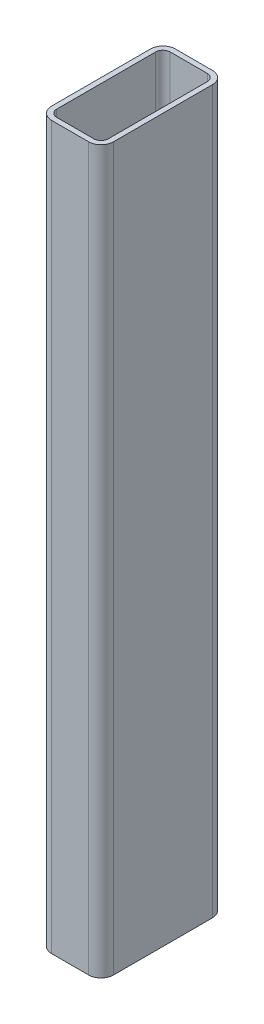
ISO-10303-21;
HEADER;
FILE_DESCRIPTION(('STEP AP214'),'2;1');
FILE_NAME('part.step','',(''),(''),'','','');
FILE_SCHEMA(('AUTOMOTIVE_DESIGN { 1 0 10303 214 1 1 1 1 }'));
ENDSEC;
DATA;
#1=APPLICATION_CONTEXT('core data for automotive mechanical design processes');
#2=APPLICATION_PROTOCOL_DEFINITION('international standard','automotive_design',2000,#1);
#3=PRODUCT_CONTEXT('',#1,'mechanical');
#4=PRODUCT('Part','Part','',(#3));
#5=PRODUCT_RELATED_PRODUCT_CATEGORY('part','',(#4));
#6=PRODUCT_DEFINITION_FORMATION('','',#4);
#7=PRODUCT_DEFINITION_CONTEXT('part definition',#1,'design');
#8=PRODUCT_DEFINITION('design','',#6,#7);
#9=PRODUCT_DEFINITION_SHAPE('','',#8);
#10=(LENGTH_UNIT() NAMED_UNIT(*) SI_UNIT(.MILLI.,.METRE.));
#11=(NAMED_UNIT(*) PLANE_ANGLE_UNIT() SI_UNIT($,.RADIAN.));
#12=(NAMED_UNIT(*) SI_UNIT($,.STERADIAN.) SOLID_ANGLE_UNIT());
#13=UNCERTAINTY_MEASURE_WITH_UNIT(LENGTH_MEASURE(1.E-05),#10,'distance_accuracy_value','');
#14=(GEOMETRIC_REPRESENTATION_CONTEXT(3) GLOBAL_UNCERTAINTY_ASSIGNED_CONTEXT((#13)) GLOBAL_UNIT_ASSIGNED_CONTEXT((#10,
#11,#12)) REPRESENTATION_CONTEXT('',''));
#15=CARTESIAN_POINT('',(0.,0.,0.));
#16=DIRECTION('',(0.,0.,1.));
#17=DIRECTION('',(1.,0.,0.));
#18=AXIS2_PLACEMENT_3D('',#15,#16,#17);
#19=CARTESIAN_POINT('',(-18.,700.,48.));
#20=DIRECTION('',(0.,-1.,0.));
#21=DIRECTION('',(0.,0.,-1.));
#22=AXIS2_PLACEMENT_3D('',#19,#20,#21);
#23=CYLINDRICAL_SURFACE('',#22,12.);
#24=CARTESIAN_POINT('',(-18.,0.,48.));
#25=DIRECTION('',(0.,1.,0.));
#26=DIRECTION('',(0.,0.,1.));
#27=AXIS2_PLACEMENT_3D('',#24,#25,#26);
#28=CIRCLE('',#27,12.);
#29=CARTESIAN_POINT('',(-30.,0.,48.));
#30=VERTEX_POINT('',#29);
#31=CARTESIAN_POINT('',(-18.,0.,60.));
#32=VERTEX_POINT('',#31);
#33=EDGE_CURVE('E190',#30,#32,#28,.T.);
#34=ORIENTED_EDGE('',*,*,#33,.T.);
#35=DIRECTION('',(0.,-1.,0.));
#36=VECTOR('',#35,1.);
#37=CARTESIAN_POINT('',(-18.,700.,60.));
#38=LINE('',#37,#36);
#39=CARTESIAN_POINT('',(-18.,700.,60.));
#40=VERTEX_POINT('',#39);
#41=EDGE_CURVE('E11',#40,#32,#38,.T.);
#42=ORIENTED_EDGE('',*,*,#41,.F.);
#43=CARTESIAN_POINT('',(-18.,700.,48.));
#44=DIRECTION('',(0.,1.,0.));
#45=DIRECTION('',(0.,0.,1.));
#46=AXIS2_PLACEMENT_3D('',#43,#44,#45);
#47=CIRCLE('',#46,12.);
#48=CARTESIAN_POINT('',(-30.,700.,48.));
#49=VERTEX_POINT('',#48);
#50=EDGE_CURVE('E228',#49,#40,#47,.T.);
#51=ORIENTED_EDGE('',*,*,#50,.F.);
#52=DIRECTION('',(0.,-1.,0.));
#53=VECTOR('',#52,1.);
#54=CARTESIAN_POINT('',(-30.,700.,48.));
#55=LINE('',#54,#53);
#56=EDGE_CURVE('E160',#49,#30,#55,.T.);
#57=ORIENTED_EDGE('',*,*,#56,.T.);
#58=EDGE_LOOP('',(#34,#42,#51,#57));
#59=FACE_BOUND('',#58,.T.);
#60=ADVANCED_FACE('F35',(#59),#23,.T.);
#61=CARTESIAN_POINT('',(-18.,700.,60.));
#62=DIRECTION('',(0.,0.,-1.));
#63=DIRECTION('',(-1.,0.,0.));
#64=AXIS2_PLACEMENT_3D('',#61,#62,#63);
#65=PLANE('',#64);
#66=DIRECTION('',(1.,0.,0.));
#67=VECTOR('',#66,1.);
#68=CARTESIAN_POINT('',(-18.,0.,60.));
#69=LINE('',#68,#67);
#70=CARTESIAN_POINT('',(18.,0.,60.));
#71=VERTEX_POINT('',#70);
#72=EDGE_CURVE('E193',#32,#71,#69,.T.);
#73=ORIENTED_EDGE('',*,*,#72,.T.);
#74=DIRECTION('',(0.,-1.,0.));
#75=VECTOR('',#74,1.);
#76=CARTESIAN_POINT('',(18.,700.,60.));
#77=LINE('',#76,#75);
#78=CARTESIAN_POINT('',(18.,700.,60.));
#79=VERTEX_POINT('',#78);
#80=EDGE_CURVE('E44',#79,#71,#77,.T.);
#81=ORIENTED_EDGE('',*,*,#80,.F.);
#82=DIRECTION('',(1.,0.,0.));
#83=VECTOR('',#82,1.);
#84=CARTESIAN_POINT('',(-18.,700.,60.));
#85=LINE('',#84,#83);
#86=EDGE_CURVE('E230',#40,#79,#85,.T.);
#87=ORIENTED_EDGE('',*,*,#86,.F.);
#88=ORIENTED_EDGE('',*,*,#41,.T.);
#89=EDGE_LOOP('',(#73,#81,#87,#88));
#90=FACE_BOUND('',#89,.T.);
#91=ADVANCED_FACE('F304',(#90),#65,.F.);
#92=CARTESIAN_POINT('',(18.,700.,48.));
#93=DIRECTION('',(0.,-1.,0.));
#94=DIRECTION('',(0.,0.,-1.));
#95=AXIS2_PLACEMENT_3D('',#92,#93,#94);
#96=CYLINDRICAL_SURFACE('',#95,12.);
#97=CARTESIAN_POINT('',(18.,0.,48.));
#98=DIRECTION('',(0.,1.,0.));
#99=DIRECTION('',(0.,0.,1.));
#100=AXIS2_PLACEMENT_3D('',#97,#98,#99);
#101=CIRCLE('',#100,12.);
#102=CARTESIAN_POINT('',(30.,0.,48.));
#103=VERTEX_POINT('',#102);
#104=EDGE_CURVE('E195',#71,#103,#101,.T.);
#105=ORIENTED_EDGE('',*,*,#104,.T.);
#106=DIRECTION('',(0.,-1.,0.));
#107=VECTOR('',#106,1.);
#108=CARTESIAN_POINT('',(30.,700.,48.));
#109=LINE('',#108,#107);
#110=CARTESIAN_POINT('',(30.,700.,48.));
#111=VERTEX_POINT('',#110);
#112=EDGE_CURVE('E256',#111,#103,#109,.T.);
#113=ORIENTED_EDGE('',*,*,#112,.F.);
#114=CARTESIAN_POINT('',(18.,700.,48.));
#115=DIRECTION('',(0.,1.,0.));
#116=DIRECTION('',(0.,0.,1.));
#117=AXIS2_PLACEMENT_3D('',#114,#115,#116);
#118=CIRCLE('',#117,12.);
#119=EDGE_CURVE('E232',#79,#111,#118,.T.);
#120=ORIENTED_EDGE('',*,*,#119,.F.);
#121=ORIENTED_EDGE('',*,*,#80,.T.);
#122=EDGE_LOOP('',(#105,#113,#120,#121));
#123=FACE_BOUND('',#122,.T.);
#124=ADVANCED_FACE('F310',(#123),#96,.T.);
#125=CARTESIAN_POINT('',(30.,700.,-48.));
#126=DIRECTION('',(-1.,0.,0.));
#127=DIRECTION('',(0.,0.,1.));
#128=AXIS2_PLACEMENT_3D('',#125,#126,#127);
#129=PLANE('',#128);
#130=DIRECTION('',(0.,0.,-1.));
#131=VECTOR('',#130,1.);
#132=CARTESIAN_POINT('',(30.,0.,-48.));
#133=LINE('',#132,#131);
#134=CARTESIAN_POINT('',(30.,0.,-48.));
#135=VERTEX_POINT('',#134);
#136=EDGE_CURVE('E197',#103,#135,#133,.T.);
#137=ORIENTED_EDGE('',*,*,#136,.T.);
#138=DIRECTION('',(0.,-1.,0.));
#139=VECTOR('',#138,1.);
#140=CARTESIAN_POINT('',(30.,700.,-48.));
#141=LINE('',#140,#139);
#142=CARTESIAN_POINT('',(30.,700.,-48.));
#143=VERTEX_POINT('',#142);
#144=EDGE_CURVE('E253',#143,#135,#141,.T.);
#145=ORIENTED_EDGE('',*,*,#144,.F.);
#146=DIRECTION('',(0.,0.,-1.));
#147=VECTOR('',#146,1.);
#148=CARTESIAN_POINT('',(30.,700.,-48.));
#149=LINE('',#148,#147);
#150=EDGE_CURVE('E234',#111,#143,#149,.T.);
#151=ORIENTED_EDGE('',*,*,#150,.F.);
#152=ORIENTED_EDGE('',*,*,#112,.T.);
#153=EDGE_LOOP('',(#137,#145,#151,#152));
#154=FACE_BOUND('',#153,.T.);
#155=ADVANCED_FACE('F406',(#154),#129,.F.);
#156=CARTESIAN_POINT('',(18.,700.,-48.));
#157=DIRECTION('',(0.,-1.,0.));
#158=DIRECTION('',(0.,0.,-1.));
#159=AXIS2_PLACEMENT_3D('',#156,#157,#158);
#160=CYLINDRICAL_SURFACE('',#159,12.);
#161=CARTESIAN_POINT('',(18.,0.,-48.));
#162=DIRECTION('',(0.,1.,0.));
#163=DIRECTION('',(0.,0.,1.));
#164=AXIS2_PLACEMENT_3D('',#161,#162,#163);
#165=CIRCLE('',#164,12.);
#166=CARTESIAN_POINT('',(18.,0.,-60.));
#167=VERTEX_POINT('',#166);
#168=EDGE_CURVE('E199',#135,#167,#165,.T.);
#169=ORIENTED_EDGE('',*,*,#168,.T.);
#170=DIRECTION('',(0.,-1.,0.));
#171=VECTOR('',#170,1.);
#172=CARTESIAN_POINT('',(18.,700.,-60.));
#173=LINE('',#172,#171);
#174=CARTESIAN_POINT('',(18.,700.,-60.));
#175=VERTEX_POINT('',#174);
#176=EDGE_CURVE('E250',#175,#167,#173,.T.);
#177=ORIENTED_EDGE('',*,*,#176,.F.);
#178=CARTESIAN_POINT('',(18.,700.,-48.));
#179=DIRECTION('',(0.,1.,0.));
#180=DIRECTION('',(0.,0.,1.));
#181=AXIS2_PLACEMENT_3D('',#178,#179,#180);
#182=CIRCLE('',#181,12.);
#183=EDGE_CURVE('E236',#143,#175,#182,.T.);
#184=ORIENTED_EDGE('',*,*,#183,.F.);
#185=ORIENTED_EDGE('',*,*,#144,.T.);
#186=EDGE_LOOP('',(#169,#177,#184,#185));
#187=FACE_BOUND('',#186,.T.);
#188=ADVANCED_FACE('F414',(#187),#160,.T.);
#189=CARTESIAN_POINT('',(18.,700.,-60.));
#190=DIRECTION('',(0.,0.,1.));
#191=DIRECTION('',(1.,0.,0.));
#192=AXIS2_PLACEMENT_3D('',#189,#190,#191);
#193=PLANE('',#192);
#194=DIRECTION('',(-1.,0.,0.));
#195=VECTOR('',#194,1.);
#196=CARTESIAN_POINT('',(18.,0.,-60.));
#197=LINE('',#196,#195);
#198=CARTESIAN_POINT('',(-18.,0.,-60.));
#199=VERTEX_POINT('',#198);
#200=EDGE_CURVE('E201',#167,#199,#197,.T.);
#201=ORIENTED_EDGE('',*,*,#200,.T.);
#202=DIRECTION('',(0.,-1.,0.));
#203=VECTOR('',#202,1.);
#204=CARTESIAN_POINT('',(-18.,700.,-60.));
#205=LINE('',#204,#203);
#206=CARTESIAN_POINT('',(-18.,700.,-60.));
#207=VERTEX_POINT('',#206);
#208=EDGE_CURVE('E247',#207,#199,#205,.T.);
#209=ORIENTED_EDGE('',*,*,#208,.F.);
#210=DIRECTION('',(-1.,0.,0.));
#211=VECTOR('',#210,1.);
#212=CARTESIAN_POINT('',(18.,700.,-60.));
#213=LINE('',#212,#211);
#214=EDGE_CURVE('E238',#175,#207,#213,.T.);
#215=ORIENTED_EDGE('',*,*,#214,.F.);
#216=ORIENTED_EDGE('',*,*,#176,.T.);
#217=EDGE_LOOP('',(#201,#209,#215,#216));
#218=FACE_BOUND('',#217,.T.);
#219=ADVANCED_FACE('F423',(#218),#193,.F.);
#220=CARTESIAN_POINT('',(-18.,700.,-48.));
#221=DIRECTION('',(0.,-1.,0.));
#222=DIRECTION('',(0.,0.,-1.));
#223=AXIS2_PLACEMENT_3D('',#220,#221,#222);
#224=CYLINDRICAL_SURFACE('',#223,12.);
#225=CARTESIAN_POINT('',(-18.,0.,-48.));
#226=DIRECTION('',(0.,1.,0.));
#227=DIRECTION('',(0.,0.,1.));
#228=AXIS2_PLACEMENT_3D('',#225,#226,#227);
#229=CIRCLE('',#228,12.);
#230=CARTESIAN_POINT('',(-30.,0.,-48.));
#231=VERTEX_POINT('',#230);
#232=EDGE_CURVE('E203',#199,#231,#229,.T.);
#233=ORIENTED_EDGE('',*,*,#232,.T.);
#234=DIRECTION('',(0.,-1.,0.));
#235=VECTOR('',#234,1.);
#236=CARTESIAN_POINT('',(-30.,700.,-48.));
#237=LINE('',#236,#235);
#238=CARTESIAN_POINT('',(-30.,700.,-48.));
#239=VERTEX_POINT('',#238);
#240=EDGE_CURVE('E244',#239,#231,#237,.T.);
#241=ORIENTED_EDGE('',*,*,#240,.F.);
#242=CARTESIAN_POINT('',(-18.,700.,-48.));
#243=DIRECTION('',(0.,1.,0.));
#244=DIRECTION('',(0.,0.,1.));
#245=AXIS2_PLACEMENT_3D('',#242,#243,#244);
#246=CIRCLE('',#245,12.);
#247=EDGE_CURVE('E57',#207,#239,#246,.T.);
#248=ORIENTED_EDGE('',*,*,#247,.F.);
#249=ORIENTED_EDGE('',*,*,#208,.T.);
#250=EDGE_LOOP('',(#233,#241,#248,#249));
#251=FACE_BOUND('',#250,.T.);
#252=ADVANCED_FACE('F367',(#251),#224,.T.);
#253=CARTESIAN_POINT('',(18.,700.,48.));
#254=DIRECTION('',(0.,-1.,0.));
#255=DIRECTION('',(0.,0.,-1.));
#256=AXIS2_PLACEMENT_3D('',#253,#254,#255);
#257=CYLINDRICAL_SURFACE('',#256,6.99999999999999);
#258=CARTESIAN_POINT('',(18.,0.,48.));
#259=DIRECTION('',(0.,1.,0.));
#260=DIRECTION('',(0.,0.,1.));
#261=AXIS2_PLACEMENT_3D('',#258,#259,#260);
#262=CIRCLE('',#261,6.99999999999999);
#263=CARTESIAN_POINT('',(18.,0.,55.));
#264=VERTEX_POINT('',#263);
#265=CARTESIAN_POINT('',(25.,0.,48.));
#266=VERTEX_POINT('',#265);
#267=EDGE_CURVE('E163',#264,#266,#262,.T.);
#268=ORIENTED_EDGE('',*,*,#267,.F.);
#269=DIRECTION('',(0.,-1.,0.));
#270=VECTOR('',#269,1.);
#271=CARTESIAN_POINT('',(18.,700.,55.));
#272=LINE('',#271,#270);
#273=CARTESIAN_POINT('',(18.,700.,55.));
#274=VERTEX_POINT('',#273);
#275=EDGE_CURVE('E39',#274,#264,#272,.T.);
#276=ORIENTED_EDGE('',*,*,#275,.F.);
#277=CARTESIAN_POINT('',(18.,700.,48.));
#278=DIRECTION('',(0.,1.,0.));
#279=DIRECTION('',(0.,0.,1.));
#280=AXIS2_PLACEMENT_3D('',#277,#278,#279);
#281=CIRCLE('',#280,6.99999999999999);
#282=CARTESIAN_POINT('',(25.,700.,48.));
#283=VERTEX_POINT('',#282);
#284=EDGE_CURVE('E207',#274,#283,#281,.T.);
#285=ORIENTED_EDGE('',*,*,#284,.T.);
#286=DIRECTION('',(0.,-1.,0.));
#287=VECTOR('',#286,1.);
#288=CARTESIAN_POINT('',(25.,700.,48.));
#289=LINE('',#288,#287);
#290=EDGE_CURVE('E164',#283,#266,#289,.T.);
#291=ORIENTED_EDGE('',*,*,#290,.T.);
#292=EDGE_LOOP('',(#268,#276,#285,#291));
#293=FACE_BOUND('',#292,.T.);
#294=ADVANCED_FACE('F37',(#293),#257,.F.);
#295=CARTESIAN_POINT('',(-18.,700.,55.));
#296=DIRECTION('',(0.,0.,-1.));
#297=DIRECTION('',(-1.,0.,0.));
#298=AXIS2_PLACEMENT_3D('',#295,#296,#297);
#299=PLANE('',#298);
#300=DIRECTION('',(1.,0.,0.));
#301=VECTOR('',#300,1.);
#302=CARTESIAN_POINT('',(-18.,0.,55.));
#303=LINE('',#302,#301);
#304=CARTESIAN_POINT('',(-18.,0.,55.));
#305=VERTEX_POINT('',#304);
#306=EDGE_CURVE('E153',#305,#264,#303,.T.);
#307=ORIENTED_EDGE('',*,*,#306,.F.);
#308=DIRECTION('',(0.,-1.,0.));
#309=VECTOR('',#308,1.);
#310=CARTESIAN_POINT('',(-18.,700.,55.));
#311=LINE('',#310,#309);
#312=CARTESIAN_POINT('',(-18.,700.,55.));
#313=VERTEX_POINT('',#312);
#314=EDGE_CURVE('E161',#313,#305,#311,.T.);
#315=ORIENTED_EDGE('',*,*,#314,.F.);
#316=DIRECTION('',(1.,0.,0.));
#317=VECTOR('',#316,1.);
#318=CARTESIAN_POINT('',(-18.,700.,55.));
#319=LINE('',#318,#317);
#320=EDGE_CURVE('E156',#313,#274,#319,.T.);
#321=ORIENTED_EDGE('',*,*,#320,.T.);
#322=ORIENTED_EDGE('',*,*,#275,.T.);
#323=EDGE_LOOP('',(#307,#315,#321,#322));
#324=FACE_BOUND('',#323,.T.);
#325=ADVANCED_FACE('F151',(#324),#299,.T.);
#326=CARTESIAN_POINT('',(-18.,700.,48.));
#327=DIRECTION('',(0.,-1.,0.));
#328=DIRECTION('',(0.,0.,-1.));
#329=AXIS2_PLACEMENT_3D('',#326,#327,#328);
#330=CYLINDRICAL_SURFACE('',#329,6.99999999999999);
#331=CARTESIAN_POINT('',(-18.,0.,48.));
#332=DIRECTION('',(0.,1.,0.));
#333=DIRECTION('',(0.,0.,1.));
#334=AXIS2_PLACEMENT_3D('',#331,#332,#333);
#335=CIRCLE('',#334,6.99999999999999);
#336=CARTESIAN_POINT('',(-25.,0.,48.));
#337=VERTEX_POINT('',#336);
#338=EDGE_CURVE('E173',#337,#305,#335,.T.);
#339=ORIENTED_EDGE('',*,*,#338,.F.);
#340=DIRECTION('',(0.,-1.,0.));
#341=VECTOR('',#340,1.);
#342=CARTESIAN_POINT('',(-25.,700.,48.));
#343=LINE('',#342,#341);
#344=CARTESIAN_POINT('',(-25.,700.,48.));
#345=VERTEX_POINT('',#344);
#346=EDGE_CURVE('E270',#345,#337,#343,.T.);
#347=ORIENTED_EDGE('',*,*,#346,.F.);
#348=CARTESIAN_POINT('',(-18.,700.,48.));
#349=DIRECTION('',(0.,1.,0.));
#350=DIRECTION('',(0.,0.,1.));
#351=AXIS2_PLACEMENT_3D('',#348,#349,#350);
#352=CIRCLE('',#351,6.99999999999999);
#353=EDGE_CURVE('E210',#345,#313,#352,.T.);
#354=ORIENTED_EDGE('',*,*,#353,.T.);
#355=ORIENTED_EDGE('',*,*,#314,.T.);
#356=EDGE_LOOP('',(#339,#347,#354,#355));
#357=FACE_BOUND('',#356,.T.);
#358=ADVANCED_FACE('F272',(#357),#330,.F.);
#359=CARTESIAN_POINT('',(-25.,700.,48.));
#360=DIRECTION('',(1.,0.,0.));
#361=DIRECTION('',(0.,0.,-1.));
#362=AXIS2_PLACEMENT_3D('',#359,#360,#361);
#363=PLANE('',#362);
#364=DIRECTION('',(0.,0.,1.));
#365=VECTOR('',#364,1.);
#366=CARTESIAN_POINT('',(-25.,0.,48.));
#367=LINE('',#366,#365);
#368=CARTESIAN_POINT('',(-25.,0.,-48.));
#369=VERTEX_POINT('',#368);
#370=EDGE_CURVE('E175',#369,#337,#367,.T.);
#371=ORIENTED_EDGE('',*,*,#370,.F.);
#372=DIRECTION('',(0.,-1.,0.));
#373=VECTOR('',#372,1.);
#374=CARTESIAN_POINT('',(-25.,700.,-48.));
#375=LINE('',#374,#373);
#376=CARTESIAN_POINT('',(-25.,700.,-48.));
#377=VERTEX_POINT('',#376);
#378=EDGE_CURVE('E268',#377,#369,#375,.T.);
#379=ORIENTED_EDGE('',*,*,#378,.F.);
#380=DIRECTION('',(0.,0.,1.));
#381=VECTOR('',#380,1.);
#382=CARTESIAN_POINT('',(-25.,700.,48.));
#383=LINE('',#382,#381);
#384=EDGE_CURVE('E213',#377,#345,#383,.T.);
#385=ORIENTED_EDGE('',*,*,#384,.T.);
#386=ORIENTED_EDGE('',*,*,#346,.T.);
#387=EDGE_LOOP('',(#371,#379,#385,#386));
#388=FACE_BOUND('',#387,.T.);
#389=ADVANCED_FACE('F294',(#388),#363,.T.);
#390=CARTESIAN_POINT('',(-18.,700.,-48.));
#391=DIRECTION('',(0.,-1.,0.));
#392=DIRECTION('',(0.,0.,-1.));
#393=AXIS2_PLACEMENT_3D('',#390,#391,#392);
#394=CYLINDRICAL_SURFACE('',#393,6.99999999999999);
#395=CARTESIAN_POINT('',(-18.,0.,-48.));
#396=DIRECTION('',(0.,1.,0.));
#397=DIRECTION('',(0.,0.,1.));
#398=AXIS2_PLACEMENT_3D('',#395,#396,#397);
#399=CIRCLE('',#398,6.99999999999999);
#400=CARTESIAN_POINT('',(-18.,0.,-55.));
#401=VERTEX_POINT('',#400);
#402=EDGE_CURVE('E179',#401,#369,#399,.T.);
#403=ORIENTED_EDGE('',*,*,#402,.F.);
#404=DIRECTION('',(0.,-1.,0.));
#405=VECTOR('',#404,1.);
#406=CARTESIAN_POINT('',(-18.,700.,-55.));
#407=LINE('',#406,#405);
#408=CARTESIAN_POINT('',(-18.,700.,-55.));
#409=VERTEX_POINT('',#408);
#410=EDGE_CURVE('E266',#409,#401,#407,.T.);
#411=ORIENTED_EDGE('',*,*,#410,.F.);
#412=CARTESIAN_POINT('',(-18.,700.,-48.));
#413=DIRECTION('',(0.,1.,0.));
#414=DIRECTION('',(0.,0.,1.));
#415=AXIS2_PLACEMENT_3D('',#412,#413,#414);
#416=CIRCLE('',#415,6.99999999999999);
#417=EDGE_CURVE('E216',#409,#377,#416,.T.);
#418=ORIENTED_EDGE('',*,*,#417,.T.);
#419=ORIENTED_EDGE('',*,*,#378,.T.);
#420=EDGE_LOOP('',(#403,#411,#418,#419));
#421=FACE_BOUND('',#420,.T.);
#422=ADVANCED_FACE('F291',(#421),#394,.F.);
#423=CARTESIAN_POINT('',(18.,700.,-55.));
#424=DIRECTION('',(0.,0.,1.));
#425=DIRECTION('',(1.,0.,0.));
#426=AXIS2_PLACEMENT_3D('',#423,#424,#425);
#427=PLANE('',#426);
#428=DIRECTION('',(-1.,0.,0.));
#429=VECTOR('',#428,1.);
#430=CARTESIAN_POINT('',(18.,0.,-55.));
#431=LINE('',#430,#429);
#432=CARTESIAN_POINT('',(18.,0.,-55.));
#433=VERTEX_POINT('',#432);
#434=EDGE_CURVE('E182',#433,#401,#431,.T.);
#435=ORIENTED_EDGE('',*,*,#434,.F.);
#436=DIRECTION('',(0.,-1.,0.));
#437=VECTOR('',#436,1.);
#438=CARTESIAN_POINT('',(18.,700.,-55.));
#439=LINE('',#438,#437);
#440=CARTESIAN_POINT('',(18.,700.,-55.));
#441=VERTEX_POINT('',#440);
#442=EDGE_CURVE('E264',#441,#433,#439,.T.);
#443=ORIENTED_EDGE('',*,*,#442,.F.);
#444=DIRECTION('',(-1.,0.,0.));
#445=VECTOR('',#444,1.);
#446=CARTESIAN_POINT('',(18.,700.,-55.));
#447=LINE('',#446,#445);
#448=EDGE_CURVE('E219',#441,#409,#447,.T.);
#449=ORIENTED_EDGE('',*,*,#448,.T.);
#450=ORIENTED_EDGE('',*,*,#410,.T.);
#451=EDGE_LOOP('',(#435,#443,#449,#450));
#452=FACE_BOUND('',#451,.T.);
#453=ADVANCED_FACE('F287',(#452),#427,.T.);
#454=CARTESIAN_POINT('',(18.,700.,-48.));
#455=DIRECTION('',(0.,-1.,0.));
#456=DIRECTION('',(0.,0.,-1.));
#457=AXIS2_PLACEMENT_3D('',#454,#455,#456);
#458=CYLINDRICAL_SURFACE('',#457,6.99999999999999);
#459=CARTESIAN_POINT('',(18.,0.,-48.));
#460=DIRECTION('',(0.,1.,0.));
#461=DIRECTION('',(0.,0.,1.));
#462=AXIS2_PLACEMENT_3D('',#459,#460,#461);
#463=CIRCLE('',#462,6.99999999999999);
#464=CARTESIAN_POINT('',(25.,0.,-48.));
#465=VERTEX_POINT('',#464);
#466=EDGE_CURVE('E185',#465,#433,#463,.T.);
#467=ORIENTED_EDGE('',*,*,#466,.F.);
#468=DIRECTION('',(0.,-1.,0.));
#469=VECTOR('',#468,1.);
#470=CARTESIAN_POINT('',(25.,700.,-48.));
#471=LINE('',#470,#469);
#472=CARTESIAN_POINT('',(25.,700.,-48.));
#473=VERTEX_POINT('',#472);
#474=EDGE_CURVE('E262',#473,#465,#471,.T.);
#475=ORIENTED_EDGE('',*,*,#474,.F.);
#476=CARTESIAN_POINT('',(18.,700.,-48.));
#477=DIRECTION('',(0.,1.,0.));
#478=DIRECTION('',(0.,0.,1.));
#479=AXIS2_PLACEMENT_3D('',#476,#477,#478);
#480=CIRCLE('',#479,6.99999999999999);
#481=EDGE_CURVE('E222',#473,#441,#480,.T.);
#482=ORIENTED_EDGE('',*,*,#481,.T.);
#483=ORIENTED_EDGE('',*,*,#442,.T.);
#484=EDGE_LOOP('',(#467,#475,#482,#483));
#485=FACE_BOUND('',#484,.T.);
#486=ADVANCED_FACE('F285',(#485),#458,.F.);
#487=CARTESIAN_POINT('',(25.,700.,-48.));
#488=DIRECTION('',(-1.,0.,0.));
#489=DIRECTION('',(0.,0.,1.));
#490=AXIS2_PLACEMENT_3D('',#487,#488,#489);
#491=PLANE('',#490);
#492=DIRECTION('',(0.,0.,-1.));
#493=VECTOR('',#492,1.);
#494=CARTESIAN_POINT('',(25.,0.,-48.));
#495=LINE('',#494,#493);
#496=EDGE_CURVE('E188',#266,#465,#495,.T.);
#497=ORIENTED_EDGE('',*,*,#496,.F.);
#498=ORIENTED_EDGE('',*,*,#290,.F.);
#499=DIRECTION('',(0.,0.,-1.));
#500=VECTOR('',#499,1.);
#501=CARTESIAN_POINT('',(25.,700.,-48.));
#502=LINE('',#501,#500);
#503=EDGE_CURVE('E225',#283,#473,#502,.T.);
#504=ORIENTED_EDGE('',*,*,#503,.T.);
#505=ORIENTED_EDGE('',*,*,#474,.T.);
#506=EDGE_LOOP('',(#497,#498,#504,#505));
#507=FACE_BOUND('',#506,.T.);
#508=ADVANCED_FACE('F281',(#507),#491,.T.);
#509=CARTESIAN_POINT('',(-30.,700.,48.));
#510=DIRECTION('',(1.,0.,0.));
#511=DIRECTION('',(0.,0.,-1.));
#512=AXIS2_PLACEMENT_3D('',#509,#510,#511);
#513=PLANE('',#512);
#514=DIRECTION('',(0.,0.,1.));
#515=VECTOR('',#514,1.);
#516=CARTESIAN_POINT('',(-30.,0.,48.));
#517=LINE('',#516,#515);
#518=EDGE_CURVE('E205',#231,#30,#517,.T.);
#519=ORIENTED_EDGE('',*,*,#518,.T.);
#520=ORIENTED_EDGE('',*,*,#56,.F.);
#521=DIRECTION('',(0.,0.,1.));
#522=VECTOR('',#521,1.);
#523=CARTESIAN_POINT('',(-30.,700.,48.));
#524=LINE('',#523,#522);
#525=EDGE_CURVE('E52',#239,#49,#524,.T.);
#526=ORIENTED_EDGE('',*,*,#525,.F.);
#527=ORIENTED_EDGE('',*,*,#240,.T.);
#528=EDGE_LOOP('',(#519,#520,#526,#527));
#529=FACE_BOUND('',#528,.T.);
#530=ADVANCED_FACE('F317',(#529),#513,.F.);
#531=CARTESIAN_POINT('',(-18.,700.,48.));
#532=DIRECTION('',(0.,1.,0.));
#533=DIRECTION('',(0.,0.,1.));
#534=AXIS2_PLACEMENT_3D('',#531,#532,#533);
#535=PLANE('',#534);
#536=ORIENTED_EDGE('',*,*,#284,.F.);
#537=ORIENTED_EDGE('',*,*,#320,.F.);
#538=ORIENTED_EDGE('',*,*,#353,.F.);
#539=ORIENTED_EDGE('',*,*,#384,.F.);
#540=ORIENTED_EDGE('',*,*,#417,.F.);
#541=ORIENTED_EDGE('',*,*,#448,.F.);
#542=ORIENTED_EDGE('',*,*,#481,.F.);
#543=ORIENTED_EDGE('',*,*,#503,.F.);
#544=EDGE_LOOP('',(#536,#537,#538,#539,#540,#541,#542,#543));
#545=FACE_BOUND('',#544,.T.);
#546=ORIENTED_EDGE('',*,*,#50,.T.);
#547=ORIENTED_EDGE('',*,*,#86,.T.);
#548=ORIENTED_EDGE('',*,*,#119,.T.);
#549=ORIENTED_EDGE('',*,*,#150,.T.);
#550=ORIENTED_EDGE('',*,*,#183,.T.);
#551=ORIENTED_EDGE('',*,*,#214,.T.);
#552=ORIENTED_EDGE('',*,*,#247,.T.);
#553=ORIENTED_EDGE('',*,*,#525,.T.);
#554=EDGE_LOOP('',(#546,#547,#548,#549,#550,#551,#552,#553));
#555=FACE_BOUND('',#554,.T.);
#556=ADVANCED_FACE('F275',(#545,#555),#535,.T.);
#557=CARTESIAN_POINT('',(-18.,0.,48.));
#558=DIRECTION('',(0.,1.,0.));
#559=DIRECTION('',(0.,0.,1.));
#560=AXIS2_PLACEMENT_3D('',#557,#558,#559);
#561=PLANE('',#560);
#562=ORIENTED_EDGE('',*,*,#267,.T.);
#563=ORIENTED_EDGE('',*,*,#496,.T.);
#564=ORIENTED_EDGE('',*,*,#466,.T.);
#565=ORIENTED_EDGE('',*,*,#434,.T.);
#566=ORIENTED_EDGE('',*,*,#402,.T.);
#567=ORIENTED_EDGE('',*,*,#370,.T.);
#568=ORIENTED_EDGE('',*,*,#338,.T.);
#569=ORIENTED_EDGE('',*,*,#306,.T.);
#570=EDGE_LOOP('',(#562,#563,#564,#565,#566,#567,#568,#569));
#571=FACE_BOUND('',#570,.T.);
#572=ORIENTED_EDGE('',*,*,#33,.F.);
#573=ORIENTED_EDGE('',*,*,#518,.F.);
#574=ORIENTED_EDGE('',*,*,#232,.F.);
#575=ORIENTED_EDGE('',*,*,#200,.F.);
#576=ORIENTED_EDGE('',*,*,#168,.F.);
#577=ORIENTED_EDGE('',*,*,#136,.F.);
#578=ORIENTED_EDGE('',*,*,#104,.F.);
#579=ORIENTED_EDGE('',*,*,#72,.F.);
#580=EDGE_LOOP('',(#572,#573,#574,#575,#576,#577,#578,#579));
#581=FACE_BOUND('',#580,.T.);
#582=ADVANCED_FACE('F169',(#571,#581),#561,.F.);
#583=CLOSED_SHELL('',(#60,#91,#124,#155,#188,#219,#252,#294,#325,#358,#389,#422,#453,#486,#508,
#530,#556,#582));
#584=MANIFOLD_SOLID_BREP('B2',#583);
#585=ADVANCED_BREP_SHAPE_REPRESENTATION('',(#18,#584),#14);
#586=SHAPE_DEFINITION_REPRESENTATION(#9,#585);
ENDSEC;
END-ISO-10303-21;
